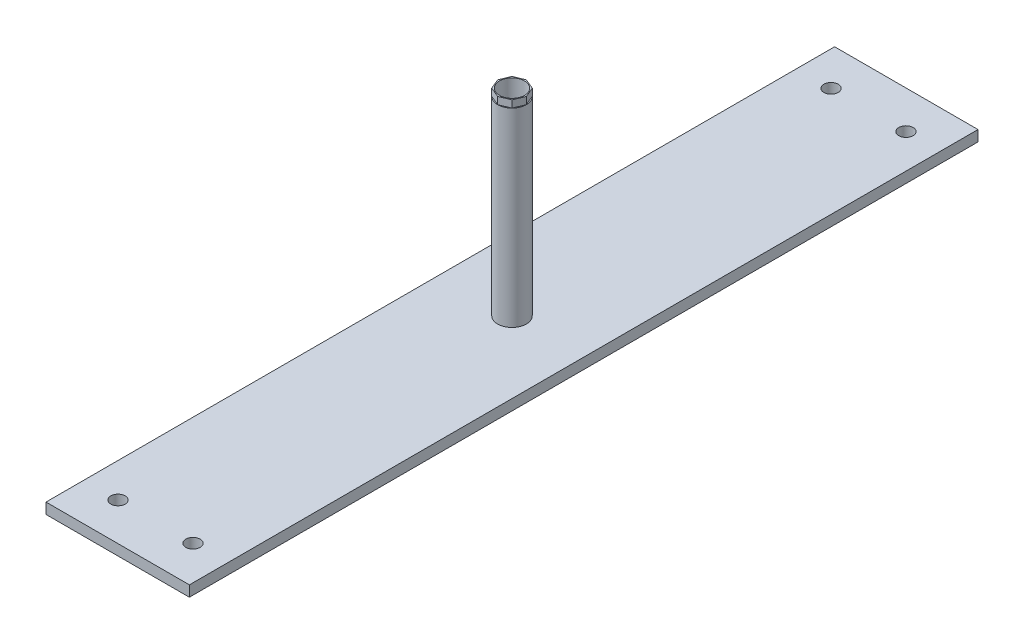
from build123d import *

# Parameters (mm, degrees)
SKETCH1_W           = 20
SKETCH1_H           = 110
BOSS_EXTRUDE1_DEPTH = 1.5
SKETCH2_R           = 1
SKETCH2_R_2         = 1.75
CUT_EXTRUDE1_DEPTH  = 1.5
BOSS_EXTRUDE2_START = 27.5
SKETCH3_R           = 2
SKETCH3_R_2         = 1.75
BOSS_EXTRUDE2_DEPTH = 27.5
CUT_EXTRUDE2_DEPTH  = 1


with BuildPart() as part:
    # Sketch1 → Boss-Extrude1 (new body)
    with BuildSketch(Plane(origin=(0, 0, 0), x_dir=(1, 0, 0), z_dir=(0, 1, 0))):
        Rectangle(SKETCH1_W, SKETCH1_H)
    extrude(amount=BOSS_EXTRUDE1_DEPTH)

    # Sketch2 → Cut-Extrude1 (cut)
    with BuildSketch(Plane(origin=(0, 1.5, 0), x_dir=(1, 0, 0), z_dir=(0, 1, 0))):
        with Locations(Location((-5.226423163, 49.726094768, 0), (0, 0, 270))):
            Circle(SKETCH2_R)
        with Locations(Location((5.226423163, 49.726094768, 0), (0, 0, 270))):
            Circle(SKETCH2_R)
        with Locations(Location((5.226423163, -49.726094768, 0), (0, 0, 270))):
            Circle(SKETCH2_R)
        with Locations(Location((-5.226423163, -49.726094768, 0), (0, 0, 270))):
            Circle(SKETCH2_R)
        with Locations(Location((0, 0, 0), (0, 0, 270))):
            Circle(SKETCH2_R_2)
    extrude(amount=-CUT_EXTRUDE1_DEPTH, mode=Mode.SUBTRACT)

    # Sketch3 → Boss-Extrude2 (add)
    with BuildSketch(Plane(origin=(0, 1.5, 0), x_dir=(1, 0, 0), z_dir=(0, 1, 0)).offset(BOSS_EXTRUDE2_START)):
        with Locations(Location((0, 0, 0), (0, 0, 90))):
            Circle(SKETCH3_R)
        with Locations(Location((0, 0, 0), (0, 0, 270))):
            Circle(SKETCH3_R_2, mode=Mode.SUBTRACT)
    extrude(amount=-BOSS_EXTRUDE2_DEPTH)

    # Sketch4 → Cut-Extrude2 (cut)
    with BuildSketch(Plane(origin=(0, 29, 0), x_dir=(1, 0, 0), z_dir=(0, 1, 0))):
        with BuildLine():
            ThreePointArc((1.414213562, -1.414213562), (1.847759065, -0.765366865), (2, 0))
            Line((2, 0), (1.414213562, -1.414213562))
        make_face()
        with BuildLine():
            Line((1.414213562, 1.414213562), (2, 0))
            ThreePointArc((2, 0), (1.847759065, 0.765366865), (1.414213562, 1.414213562))
        make_face()
        with BuildLine():
            ThreePointArc((0, -2), (0.765366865, -1.847759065), (1.414213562, -1.414213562))
            Line((1.414213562, -1.414213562), (0, -2))
        make_face()
        with BuildLine():
            ThreePointArc((-1.414213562, -1.414213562), (-0.765366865, -1.847759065), (0, -2))
            Line((0, -2), (-1.414213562, -1.414213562))
        make_face()
        with BuildLine():
            ThreePointArc((-2, 0), (-1.847759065, -0.765366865), (-1.414213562, -1.414213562))
            Line((-1.414213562, -1.414213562), (-2, 0))
        make_face()
        with BuildLine():
            Line((-2, 0), (-1.414213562, 1.414213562))
            ThreePointArc((-1.414213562, 1.414213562), (-1.847759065, 0.765366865), (-2, 0))
        make_face()
        with BuildLine():
            Line((-1.414213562, 1.414213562), (0, 2))
            ThreePointArc((0, 2), (-0.765366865, 1.847759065), (-1.414213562, 1.414213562))
        make_face()
        with BuildLine():
            Line((0, 2), (1.414213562, 1.414213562))
            ThreePointArc((1.414213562, 1.414213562), (0.765366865, 1.847759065), (0, 2))
        make_face()
    extrude(amount=-CUT_EXTRUDE2_DEPTH, mode=Mode.SUBTRACT)


solid = part.part
